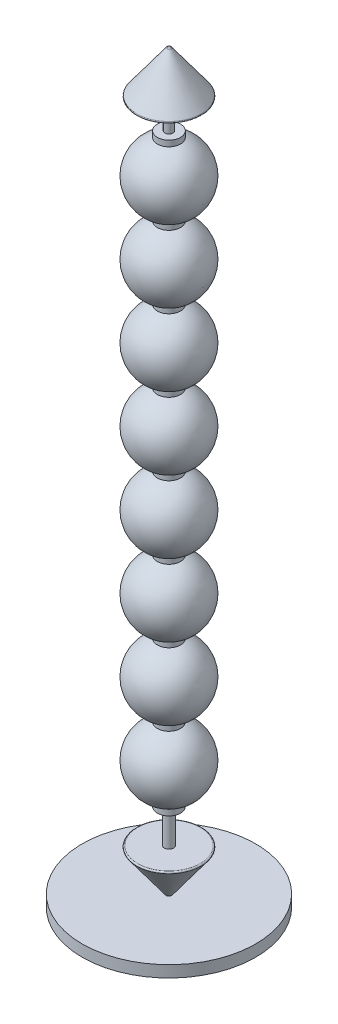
ISO-10303-21;
HEADER;
FILE_DESCRIPTION(('STEP AP214'),'2;1');
FILE_NAME('part.step','',(''),(''),'','','');
FILE_SCHEMA(('AUTOMOTIVE_DESIGN { 1 0 10303 214 1 1 1 1 }'));
ENDSEC;
DATA;
#1=APPLICATION_CONTEXT('core data for automotive mechanical design processes');
#2=APPLICATION_PROTOCOL_DEFINITION('international standard','automotive_design',2000,#1);
#3=PRODUCT_CONTEXT('',#1,'mechanical');
#4=PRODUCT('Part','Part','',(#3));
#5=PRODUCT_RELATED_PRODUCT_CATEGORY('part','',(#4));
#6=PRODUCT_DEFINITION_FORMATION('','',#4);
#7=PRODUCT_DEFINITION_CONTEXT('part definition',#1,'design');
#8=PRODUCT_DEFINITION('design','',#6,#7);
#9=PRODUCT_DEFINITION_SHAPE('','',#8);
#10=(LENGTH_UNIT() NAMED_UNIT(*) SI_UNIT(.MILLI.,.METRE.));
#11=(NAMED_UNIT(*) PLANE_ANGLE_UNIT() SI_UNIT($,.RADIAN.));
#12=(NAMED_UNIT(*) SI_UNIT($,.STERADIAN.) SOLID_ANGLE_UNIT());
#13=UNCERTAINTY_MEASURE_WITH_UNIT(LENGTH_MEASURE(1.E-05),#10,'distance_accuracy_value','');
#14=(GEOMETRIC_REPRESENTATION_CONTEXT(3) GLOBAL_UNCERTAINTY_ASSIGNED_CONTEXT((#13)) GLOBAL_UNIT_ASSIGNED_CONTEXT((#10,
#11,#12)) REPRESENTATION_CONTEXT('',''));
#15=CARTESIAN_POINT('',(0.,0.,0.));
#16=DIRECTION('',(0.,0.,1.));
#17=DIRECTION('',(1.,0.,0.));
#18=AXIS2_PLACEMENT_3D('',#15,#16,#17);
#19=CARTESIAN_POINT('',(0.,150.737071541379,0.));
#20=DIRECTION('',(0.,-1.,0.));
#21=DIRECTION('',(1.,0.,0.));
#22=AXIS2_PLACEMENT_3D('',#19,#20,#21);
#23=PLANE('',#22);
#24=CARTESIAN_POINT('',(0.,150.737071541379,0.));
#25=DIRECTION('',(0.,-1.,0.));
#26=DIRECTION('',(1.,0.,0.));
#27=AXIS2_PLACEMENT_3D('',#24,#25,#26);
#28=CIRCLE('',#27,20.);
#29=CARTESIAN_POINT('',(20.,150.737071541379,0.));
#30=VERTEX_POINT('',#29);
#31=EDGE_CURVE('E11',#30,#30,#28,.T.);
#32=ORIENTED_EDGE('',*,*,#31,.T.);
#33=EDGE_LOOP('',(#32));
#34=FACE_BOUND('',#33,.T.);
#35=ADVANCED_FACE('F39',(#34),#23,.T.);
#36=CARTESIAN_POINT('',(0.,0.,0.));
#37=DIRECTION('',(0.,-1.,0.));
#38=DIRECTION('',(1.,0.,0.));
#39=AXIS2_PLACEMENT_3D('',#36,#37,#38);
#40=CYLINDRICAL_SURFACE('',#39,20.);
#41=CARTESIAN_POINT('',(0.,160.737071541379,0.));
#42=DIRECTION('',(0.,-1.,0.));
#43=DIRECTION('',(1.,0.,0.));
#44=AXIS2_PLACEMENT_3D('',#41,#42,#43);
#45=CIRCLE('',#44,20.);
#46=CARTESIAN_POINT('',(20.,160.737071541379,0.));
#47=VERTEX_POINT('',#46);
#48=EDGE_CURVE('E45',#47,#47,#45,.T.);
#49=ORIENTED_EDGE('',*,*,#48,.T.);
#50=EDGE_LOOP('',(#49));
#51=FACE_BOUND('',#50,.T.);
#52=ORIENTED_EDGE('',*,*,#31,.F.);
#53=EDGE_LOOP('',(#52));
#54=FACE_BOUND('',#53,.T.);
#55=ADVANCED_FACE('F51',(#51,#54),#40,.T.);
#56=CARTESIAN_POINT('',(0.,160.737071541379,0.));
#57=DIRECTION('',(0.,1.,0.));
#58=DIRECTION('',(-1.,0.,0.));
#59=AXIS2_PLACEMENT_3D('',#56,#57,#58);
#60=PLANE('',#59);
#61=ORIENTED_EDGE('',*,*,#48,.F.);
#62=EDGE_LOOP('',(#61));
#63=FACE_BOUND('',#62,.T.);
#64=ADVANCED_FACE('F54',(#63),#60,.T.);
#65=CLOSED_SHELL('',(#35,#55,#64));
#66=MANIFOLD_SOLID_BREP('B2',#65);
#67=CARTESIAN_POINT('',(0.,1162.49004311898,0.));
#68=DIRECTION('',(0.,1.,0.));
#69=DIRECTION('',(0.,0.,1.));
#70=AXIS2_PLACEMENT_3D('',#67,#68,#69);
#71=PLANE('',#70);
#72=CARTESIAN_POINT('',(0.,1162.49004311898,0.));
#73=DIRECTION('',(0.,-1.,0.));
#74=DIRECTION('',(0.,0.,-1.));
#75=AXIS2_PLACEMENT_3D('',#72,#73,#74);
#76=CIRCLE('',#75,7.);
#77=CARTESIAN_POINT('',(0.,1162.49004311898,-7.));
#78=VERTEX_POINT('',#77);
#79=EDGE_CURVE('E38',#78,#78,#76,.T.);
#80=ORIENTED_EDGE('',*,*,#79,.T.);
#81=EDGE_LOOP('',(#80));
#82=FACE_BOUND('',#81,.T.);
#83=ADVANCED_FACE('F87',(#82),#71,.F.);
#84=CARTESIAN_POINT('',(0.,1162.49004311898,0.));
#85=DIRECTION('',(0.,-1.,0.));
#86=DIRECTION('',(0.,0.,-1.));
#87=AXIS2_PLACEMENT_3D('',#84,#85,#86);
#88=CYLINDRICAL_SURFACE('',#87,7.);
#89=ORIENTED_EDGE('',*,*,#79,.F.);
#90=EDGE_LOOP('',(#89));
#91=FACE_BOUND('',#90,.T.);
#92=CARTESIAN_POINT('',(0.,1212.49004311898,0.));
#93=DIRECTION('',(0.,-1.,0.));
#94=DIRECTION('',(0.,0.,-1.));
#95=AXIS2_PLACEMENT_3D('',#92,#93,#94);
#96=CIRCLE('',#95,7.);
#97=CARTESIAN_POINT('',(0.,1212.49004311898,-7.));
#98=VERTEX_POINT('',#97);
#99=EDGE_CURVE('E93',#98,#98,#96,.T.);
#100=ORIENTED_EDGE('',*,*,#99,.T.);
#101=EDGE_LOOP('',(#100));
#102=FACE_BOUND('',#101,.T.);
#103=ADVANCED_FACE('F99',(#91,#102),#88,.T.);
#104=CARTESIAN_POINT('',(-7.,1212.49004311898,0.));
#105=DIRECTION('',(0.,-1.,0.));
#106=DIRECTION('',(0.,0.,-1.));
#107=AXIS2_PLACEMENT_3D('',#104,#105,#106);
#108=PLANE('',#107);
#109=ORIENTED_EDGE('',*,*,#99,.F.);
#110=EDGE_LOOP('',(#109));
#111=FACE_BOUND('',#110,.T.);
#112=ADVANCED_FACE('F101',(#111),#108,.F.);
#113=CLOSED_SHELL('',(#83,#103,#112));
#114=MANIFOLD_SOLID_BREP('B6',#113);
#115=CARTESIAN_POINT('',(0.,92.4900431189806,0.));
#116=DIRECTION('',(0.,-1.,0.));
#117=DIRECTION('',(0.,0.,1.));
#118=AXIS2_PLACEMENT_3D('',#115,#116,#117);
#119=PLANE('',#118);
#120=CARTESIAN_POINT('',(0.,92.4900431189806,0.));
#121=DIRECTION('',(0.,1.,0.));
#122=DIRECTION('',(0.,0.,1.));
#123=AXIS2_PLACEMENT_3D('',#120,#121,#122);
#124=CIRCLE('',#123,54.0534554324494);
#125=CARTESIAN_POINT('',(0.,92.4900431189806,54.0534554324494));
#126=VERTEX_POINT('',#125);
#127=EDGE_CURVE('E150',#126,#126,#124,.F.);
#128=ORIENTED_EDGE('',*,*,#127,.F.);
#129=EDGE_LOOP('',(#128));
#130=FACE_BOUND('',#129,.T.);
#131=ADVANCED_FACE('F135',(#130),#119,.F.);
#132=CARTESIAN_POINT('',(1.04523968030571E-13,17.4900431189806,0.));
#133=DIRECTION('',(0.,1.,0.));
#134=DIRECTION('',(0.,0.,-1.));
#135=AXIS2_PLACEMENT_3D('',#132,#133,#134);
#136=CONICAL_SURFACE('',#135,3.00625566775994,0.632694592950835);
#137=CARTESIAN_POINT('',(1.043894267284E-13,18.3074032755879,0.));
#138=DIRECTION('',(0.,1.,0.));
#139=DIRECTION('',(0.,0.,1.));
#140=AXIS2_PLACEMENT_3D('',#137,#138,#139);
#141=CIRCLE('',#140,3.60558494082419);
#142=CARTESIAN_POINT('',(1.043894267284E-13,18.3074032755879,-3.6055849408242));
#143=VERTEX_POINT('',#142);
#144=EDGE_CURVE('E142',#143,#143,#141,.F.);
#145=CARTESIAN_POINT('',(0.,89.3074032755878,0.));
#146=DIRECTION('',(0.,1.,0.));
#147=DIRECTION('',(0.,0.,1.));
#148=AXIS2_PLACEMENT_3D('',#145,#146,#147);
#149=CIRCLE('',#148,55.6663295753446);
#150=CARTESIAN_POINT('',(0.,89.3074032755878,-55.6663295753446));
#151=VERTEX_POINT('',#150);
#152=EDGE_CURVE('E146',#151,#151,#149,.T.);
#153=CARTESIAN_POINT('',(1.043894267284E-13,18.3074032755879,-3.6055849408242));
#154=CARTESIAN_POINT('',(1.04267687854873E-13,19.0469866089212,-4.14788436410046));
#155=CARTESIAN_POINT('',(1.04145948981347E-13,19.7865699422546,-4.69018378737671));
#156=CARTESIAN_POINT('',(1.03902471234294E-13,21.2657366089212,-5.77478263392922));
#157=CARTESIAN_POINT('',(1.03780732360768E-13,22.0053199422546,-6.31708205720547));
#158=CARTESIAN_POINT('',(1.03537254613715E-13,23.4844866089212,-7.40168090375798));
#159=CARTESIAN_POINT('',(1.03415515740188E-13,24.2240699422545,-7.94398032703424));
#160=CARTESIAN_POINT('',(1.03172037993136E-13,25.7032366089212,-9.02857917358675));
#161=CARTESIAN_POINT('',(1.03050299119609E-13,26.4428199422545,-9.570878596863));
#162=CARTESIAN_POINT('',(1.02806821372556E-13,27.9219866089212,-10.6554774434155));
#163=CARTESIAN_POINT('',(1.0268508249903E-13,28.6615699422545,-11.1977768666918));
#164=CARTESIAN_POINT('',(1.02441604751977E-13,30.1407366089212,-12.2823757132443));
#165=CARTESIAN_POINT('',(1.02319865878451E-13,30.8803199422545,-12.8246751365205));
#166=CARTESIAN_POINT('',(1.02076388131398E-13,32.3594866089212,-13.909273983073));
#167=CARTESIAN_POINT('',(1.01954649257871E-13,33.0990699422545,-14.4515734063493));
#168=CARTESIAN_POINT('',(1.01711171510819E-13,34.5782366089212,-15.5361722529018));
#169=CARTESIAN_POINT('',(1.01589432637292E-13,35.3178199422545,-16.0784716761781));
#170=CARTESIAN_POINT('',(1.01345954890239E-13,36.7969866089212,-17.1630705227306));
#171=CARTESIAN_POINT('',(1.01224216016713E-13,37.5365699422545,-17.7053699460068));
#172=CARTESIAN_POINT('',(1.0098073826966E-13,39.0157366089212,-18.7899687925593));
#173=CARTESIAN_POINT('',(1.00858999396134E-13,39.7553199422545,-19.3322682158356));
#174=CARTESIAN_POINT('',(1.00615521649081E-13,41.2344866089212,-20.4168670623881));
#175=CARTESIAN_POINT('',(1.00493782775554E-13,41.9740699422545,-20.9591664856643));
#176=CARTESIAN_POINT('',(1.00250305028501E-13,43.4532366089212,-22.0437653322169));
#177=CARTESIAN_POINT('',(1.00128566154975E-13,44.1928199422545,-22.5860647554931));
#178=CARTESIAN_POINT('',(0.,45.6719866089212,-23.6706636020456));
#179=CARTESIAN_POINT('',(0.,46.4115699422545,-24.2129630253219));
#180=CARTESIAN_POINT('',(0.,47.8907366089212,-25.2975618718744));
#181=CARTESIAN_POINT('',(0.,48.6303199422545,-25.8398612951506));
#182=CARTESIAN_POINT('',(0.,50.1094866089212,-26.9244601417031));
#183=CARTESIAN_POINT('',(0.,50.8490699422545,-27.4667595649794));
#184=CARTESIAN_POINT('',(0.,52.3282366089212,-28.5513584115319));
#185=CARTESIAN_POINT('',(0.,53.0678199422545,-29.0936578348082));
#186=CARTESIAN_POINT('',(0.,54.5469866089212,-30.1782566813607));
#187=CARTESIAN_POINT('',(0.,55.2865699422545,-30.7205561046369));
#188=CARTESIAN_POINT('',(0.,56.7657366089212,-31.8051549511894));
#189=CARTESIAN_POINT('',(0.,57.5053199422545,-32.3474543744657));
#190=CARTESIAN_POINT('',(0.,58.9844866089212,-33.4320532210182));
#191=CARTESIAN_POINT('',(0.,59.7240699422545,-33.9743526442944));
#192=CARTESIAN_POINT('',(0.,61.2032366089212,-35.058951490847));
#193=CARTESIAN_POINT('',(0.,61.9428199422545,-35.6012509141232));
#194=CARTESIAN_POINT('',(0.,63.4219866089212,-36.6858497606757));
#195=CARTESIAN_POINT('',(0.,64.1615699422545,-37.228149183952));
#196=CARTESIAN_POINT('',(0.,65.6407366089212,-38.3127480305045));
#197=CARTESIAN_POINT('',(0.,66.3803199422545,-38.8550474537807));
#198=CARTESIAN_POINT('',(0.,67.8594866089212,-39.9396463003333));
#199=CARTESIAN_POINT('',(0.,68.5990699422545,-40.4819457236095));
#200=CARTESIAN_POINT('',(0.,70.0782366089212,-41.566544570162));
#201=CARTESIAN_POINT('',(0.,70.8178199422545,-42.1088439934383));
#202=CARTESIAN_POINT('',(0.,72.2969866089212,-43.1934428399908));
#203=CARTESIAN_POINT('',(0.,73.0365699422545,-43.735742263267));
#204=CARTESIAN_POINT('',(0.,74.5157366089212,-44.8203411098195));
#205=CARTESIAN_POINT('',(0.,75.2553199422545,-45.3626405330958));
#206=CARTESIAN_POINT('',(0.,76.7344866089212,-46.4472393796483));
#207=CARTESIAN_POINT('',(0.,77.4740699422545,-46.9895388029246));
#208=CARTESIAN_POINT('',(0.,78.9532366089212,-48.0741376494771));
#209=CARTESIAN_POINT('',(0.,79.6928199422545,-48.6164370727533));
#210=CARTESIAN_POINT('',(0.,81.1719866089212,-49.7010359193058));
#211=CARTESIAN_POINT('',(0.,81.9115699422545,-50.2433353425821));
#212=CARTESIAN_POINT('',(0.,83.3907366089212,-51.3279341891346));
#213=CARTESIAN_POINT('',(0.,84.1303199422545,-51.8702336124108));
#214=CARTESIAN_POINT('',(0.,85.6094866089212,-52.9548324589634));
#215=CARTESIAN_POINT('',(0.,86.3490699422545,-53.4971318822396));
#216=CARTESIAN_POINT('',(0.,87.8282366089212,-54.5817307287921));
#217=CARTESIAN_POINT('',(0.,88.5678199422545,-55.1240301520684));
#218=CARTESIAN_POINT('',(0.,89.3074032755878,-55.6663295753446));
#219=B_SPLINE_CURVE_WITH_KNOTS('',3,(#153,#154,#155,#156,#157,#158,#159,#160,#161,#162,#163,
#164,#165,#166,#167,#168,#169,#170,#171,#172,#173,#174,#175,#176,#177,#178,#179,#180,#181,#182,
#183,#184,#185,#186,#187,#188,#189,#190,#191,#192,#193,#194,#195,#196,#197,#198,#199,#200,#201,
#202,#203,#204,#205,#206,#207,#208,#209,#210,#211,#212,#213,#214,#215,#216,#217,#218),
.UNSPECIFIED.,.F.,.F.,(4,2,2,2,2,2,2,2,2,2,2,2,2,2,2,2,2,2,2,2,2,2,2,2,2,2,2,2,2,2,2,2,4),(0.,
2.75129960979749,5.50259921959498,8.25389882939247,11.00519843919,13.7564980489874,
16.5077976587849,19.2590972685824,22.0103968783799,24.7616964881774,27.5129960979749,
30.2642957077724,33.0155953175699,35.7668949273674,38.5181945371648,41.2694941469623,
44.0207937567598,46.7720933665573,49.5233929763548,52.2746925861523,55.0259921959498,
57.7772918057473,60.5285914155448,63.2798910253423,66.0311906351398,68.7824902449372,
71.5337898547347,74.2850894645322,77.0363890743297,79.7876886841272,82.5389882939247,
85.2902879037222,88.0415875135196),.UNSPECIFIED.);
#220=EDGE_CURVE('BSEAM159',#143,#151,#219,.T.);
#221=ORIENTED_EDGE('',*,*,#144,.F.);
#222=ORIENTED_EDGE('',*,*,#152,.F.);
#223=ORIENTED_EDGE('',*,*,#220,.T.);
#224=ORIENTED_EDGE('',*,*,#220,.F.);
#225=EDGE_LOOP('',(#221,#223,#222,#224));
#226=FACE_BOUND('',#225,.T.);
#227=ADVANCED_FACE('F159',(#226),#136,.T.);
#228=CARTESIAN_POINT('',(-3.00625566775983,17.4900431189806,0.));
#229=DIRECTION('',(0.,1.,0.));
#230=DIRECTION('',(0.,0.,-1.));
#231=AXIS2_PLACEMENT_3D('',#228,#229,#230);
#232=PLANE('',#231);
#233=CARTESIAN_POINT('',(1.04523968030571E-13,17.4900431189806,0.));
#234=DIRECTION('',(0.,-1.,0.));
#235=DIRECTION('',(0.,0.,-1.));
#236=AXIS2_PLACEMENT_3D('',#233,#234,#235);
#237=CIRCLE('',#236,1.99271079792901);
#238=CARTESIAN_POINT('',(1.04523968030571E-13,17.4900431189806,-1.99271079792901));
#239=VERTEX_POINT('',#238);
#240=EDGE_CURVE('E86',#239,#239,#237,.F.);
#241=ORIENTED_EDGE('',*,*,#240,.F.);
#242=EDGE_LOOP('',(#241));
#243=FACE_BOUND('',#242,.T.);
#244=ADVANCED_FACE('F164',(#243),#232,.F.);
#245=CARTESIAN_POINT('',(0.,90.4900431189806,0.));
#246=DIRECTION('',(0.,-1.,0.));
#247=DIRECTION('',(0.,0.,1.));
#248=AXIS2_PLACEMENT_3D('',#245,#246,#247);
#249=TOROIDAL_SURFACE('',#248,54.0534554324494,2.);
#250=ORIENTED_EDGE('',*,*,#152,.T.);
#251=EDGE_LOOP('',(#250));
#252=FACE_BOUND('',#251,.T.);
#253=ORIENTED_EDGE('',*,*,#127,.T.);
#254=EDGE_LOOP('',(#253));
#255=FACE_BOUND('',#254,.T.);
#256=ADVANCED_FACE('F156',(#252,#255),#249,.T.);
#257=CARTESIAN_POINT('',(1.04194758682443E-13,19.4900431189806,0.));
#258=DIRECTION('',(0.,1.,0.));
#259=DIRECTION('',(0.,0.,-1.));
#260=AXIS2_PLACEMENT_3D('',#257,#258,#259);
#261=DEGENERATE_TOROIDAL_SURFACE('',#260,1.99271079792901,2.,.T.);
#262=ORIENTED_EDGE('',*,*,#240,.T.);
#263=EDGE_LOOP('',(#262));
#264=FACE_BOUND('',#263,.T.);
#265=ORIENTED_EDGE('',*,*,#144,.T.);
#266=EDGE_LOOP('',(#265));
#267=FACE_BOUND('',#266,.T.);
#268=ADVANCED_FACE('F137',(#264,#267),#261,.T.);
#269=CLOSED_SHELL('',(#131,#227,#244,#256,#268));
#270=MANIFOLD_SOLID_BREP('B33',#269);
#271=CARTESIAN_POINT('',(0.,1212.49004311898,0.));
#272=DIRECTION('',(0.,1.,0.));
#273=DIRECTION('',(0.,0.,1.));
#274=AXIS2_PLACEMENT_3D('',#271,#272,#273);
#275=PLANE('',#274);
#276=CARTESIAN_POINT('',(0.,1212.49004311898,0.));
#277=DIRECTION('',(0.,1.,0.));
#278=DIRECTION('',(0.,0.,1.));
#279=AXIS2_PLACEMENT_3D('',#276,#277,#278);
#280=CIRCLE('',#279,54.0534554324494);
#281=CARTESIAN_POINT('',(0.,1212.49004311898,54.0534554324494));
#282=VERTEX_POINT('',#281);
#283=EDGE_CURVE('E228',#282,#282,#280,.F.);
#284=ORIENTED_EDGE('',*,*,#283,.T.);
#285=EDGE_LOOP('',(#284));
#286=FACE_BOUND('',#285,.T.);
#287=ADVANCED_FACE('F213',(#286),#275,.F.);
#288=CARTESIAN_POINT('',(0.,1287.49004311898,0.));
#289=DIRECTION('',(0.,-1.,0.));
#290=DIRECTION('',(0.,0.,-1.));
#291=AXIS2_PLACEMENT_3D('',#288,#289,#290);
#292=CONICAL_SURFACE('',#291,3.00625566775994,0.632694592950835);
#293=CARTESIAN_POINT('',(0.,1286.67268296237,0.));
#294=DIRECTION('',(0.,1.,0.));
#295=DIRECTION('',(0.,0.,1.));
#296=AXIS2_PLACEMENT_3D('',#293,#294,#295);
#297=CIRCLE('',#296,3.60558494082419);
#298=CARTESIAN_POINT('',(0.,1286.67268296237,-3.60558494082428));
#299=VERTEX_POINT('',#298);
#300=EDGE_CURVE('E220',#299,#299,#297,.F.);
#301=CARTESIAN_POINT('',(0.,1215.67268296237,0.));
#302=DIRECTION('',(0.,1.,0.));
#303=DIRECTION('',(0.,0.,1.));
#304=AXIS2_PLACEMENT_3D('',#301,#302,#303);
#305=CIRCLE('',#304,55.6663295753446);
#306=CARTESIAN_POINT('',(0.,1215.67268296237,-55.6663295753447));
#307=VERTEX_POINT('',#306);
#308=EDGE_CURVE('E224',#307,#307,#305,.T.);
#309=CARTESIAN_POINT('',(0.,1286.67268296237,-3.60558494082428));
#310=CARTESIAN_POINT('',(0.,1285.93309962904,-4.14788436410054));
#311=CARTESIAN_POINT('',(0.,1285.19351629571,-4.6901837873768));
#312=CARTESIAN_POINT('',(0.,1283.71434962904,-5.7747826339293));
#313=CARTESIAN_POINT('',(0.,1282.97476629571,-6.31708205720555));
#314=CARTESIAN_POINT('',(0.,1281.49559962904,-7.40168090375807));
#315=CARTESIAN_POINT('',(0.,1280.75601629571,-7.94398032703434));
#316=CARTESIAN_POINT('',(0.,1279.27684962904,-9.02857917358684));
#317=CARTESIAN_POINT('',(0.,1278.53726629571,-9.57087859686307));
#318=CARTESIAN_POINT('',(0.,1277.05809962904,-10.6554774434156));
#319=CARTESIAN_POINT('',(0.,1276.31851629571,-11.1977768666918));
#320=CARTESIAN_POINT('',(0.,1274.83934962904,-12.2823757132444));
#321=CARTESIAN_POINT('',(0.,1274.09976629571,-12.8246751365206));
#322=CARTESIAN_POINT('',(0.,1272.62059962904,-13.9092739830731));
#323=CARTESIAN_POINT('',(0.,1271.88101629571,-14.4515734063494));
#324=CARTESIAN_POINT('',(0.,1270.40184962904,-15.5361722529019));
#325=CARTESIAN_POINT('',(0.,1269.66226629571,-16.0784716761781));
#326=CARTESIAN_POINT('',(0.,1268.18309962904,-17.1630705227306));
#327=CARTESIAN_POINT('',(0.,1267.44351629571,-17.7053699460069));
#328=CARTESIAN_POINT('',(0.,1265.96434962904,-18.7899687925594));
#329=CARTESIAN_POINT('',(0.,1265.22476629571,-19.3322682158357));
#330=CARTESIAN_POINT('',(0.,1263.74559962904,-20.4168670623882));
#331=CARTESIAN_POINT('',(0.,1263.00601629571,-20.9591664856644));
#332=CARTESIAN_POINT('',(0.,1261.52684962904,-22.0437653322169));
#333=CARTESIAN_POINT('',(0.,1260.78726629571,-22.5860647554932));
#334=CARTESIAN_POINT('',(0.,1259.30809962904,-23.6706636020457));
#335=CARTESIAN_POINT('',(0.,1258.56851629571,-24.212963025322));
#336=CARTESIAN_POINT('',(0.,1257.08934962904,-25.2975618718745));
#337=CARTESIAN_POINT('',(0.,1256.34976629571,-25.8398612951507));
#338=CARTESIAN_POINT('',(0.,1254.87059962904,-26.9244601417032));
#339=CARTESIAN_POINT('',(0.,1254.13101629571,-27.4667595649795));
#340=CARTESIAN_POINT('',(0.,1252.65184962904,-28.551358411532));
#341=CARTESIAN_POINT('',(0.,1251.91226629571,-29.0936578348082));
#342=CARTESIAN_POINT('',(0.,1250.43309962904,-30.1782566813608));
#343=CARTESIAN_POINT('',(0.,1249.69351629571,-30.720556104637));
#344=CARTESIAN_POINT('',(0.,1248.21434962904,-31.8051549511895));
#345=CARTESIAN_POINT('',(0.,1247.47476629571,-32.3474543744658));
#346=CARTESIAN_POINT('',(0.,1245.99559962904,-33.4320532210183));
#347=CARTESIAN_POINT('',(0.,1245.25601629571,-33.9743526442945));
#348=CARTESIAN_POINT('',(0.,1243.77684962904,-35.0589514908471));
#349=CARTESIAN_POINT('',(0.,1243.03726629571,-35.6012509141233));
#350=CARTESIAN_POINT('',(0.,1241.55809962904,-36.6858497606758));
#351=CARTESIAN_POINT('',(0.,1240.81851629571,-37.2281491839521));
#352=CARTESIAN_POINT('',(0.,1239.33934962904,-38.3127480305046));
#353=CARTESIAN_POINT('',(0.,1238.59976629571,-38.8550474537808));
#354=CARTESIAN_POINT('',(0.,1237.12059962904,-39.9396463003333));
#355=CARTESIAN_POINT('',(0.,1236.38101629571,-40.4819457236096));
#356=CARTESIAN_POINT('',(0.,1234.90184962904,-41.5665445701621));
#357=CARTESIAN_POINT('',(0.,1234.16226629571,-42.1088439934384));
#358=CARTESIAN_POINT('',(0.,1232.68309962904,-43.1934428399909));
#359=CARTESIAN_POINT('',(0.,1231.94351629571,-43.7357422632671));
#360=CARTESIAN_POINT('',(0.,1230.46434962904,-44.8203411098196));
#361=CARTESIAN_POINT('',(0.,1229.72476629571,-45.3626405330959));
#362=CARTESIAN_POINT('',(0.,1228.24559962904,-46.4472393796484));
#363=CARTESIAN_POINT('',(0.,1227.50601629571,-46.9895388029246));
#364=CARTESIAN_POINT('',(0.,1226.02684962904,-48.0741376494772));
#365=CARTESIAN_POINT('',(0.,1225.28726629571,-48.6164370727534));
#366=CARTESIAN_POINT('',(0.,1223.80809962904,-49.7010359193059));
#367=CARTESIAN_POINT('',(0.,1223.06851629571,-50.2433353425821));
#368=CARTESIAN_POINT('',(0.,1221.58934962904,-51.3279341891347));
#369=CARTESIAN_POINT('',(0.,1220.84976629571,-51.8702336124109));
#370=CARTESIAN_POINT('',(0.,1219.37059962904,-52.9548324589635));
#371=CARTESIAN_POINT('',(0.,1218.63101629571,-53.4971318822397));
#372=CARTESIAN_POINT('',(0.,1217.15184962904,-54.5817307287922));
#373=CARTESIAN_POINT('',(0.,1216.41226629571,-55.1240301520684));
#374=CARTESIAN_POINT('',(0.,1215.67268296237,-55.6663295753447));
#375=B_SPLINE_CURVE_WITH_KNOTS('',3,(#309,#310,#311,#312,#313,#314,#315,#316,#317,#318,#319,
#320,#321,#322,#323,#324,#325,#326,#327,#328,#329,#330,#331,#332,#333,#334,#335,#336,#337,#338,
#339,#340,#341,#342,#343,#344,#345,#346,#347,#348,#349,#350,#351,#352,#353,#354,#355,#356,#357,
#358,#359,#360,#361,#362,#363,#364,#365,#366,#367,#368,#369,#370,#371,#372,#373,#374),
.UNSPECIFIED.,.F.,.F.,(4,2,2,2,2,2,2,2,2,2,2,2,2,2,2,2,2,2,2,2,2,2,2,2,2,2,2,2,2,2,2,2,4),(0.,
2.75129960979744,5.50259921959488,8.25389882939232,11.0051984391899,13.7564980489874,
16.5077976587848,19.2590972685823,22.0103968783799,24.7616964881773,27.5129960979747,
30.2642957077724,33.0155953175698,35.7668949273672,38.5181945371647,41.2694941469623,
44.0207937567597,46.7720933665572,49.5233929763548,52.2746925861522,55.0259921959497,
57.7772918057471,60.5285914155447,63.2798910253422,66.0311906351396,68.7824902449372,
71.5337898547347,74.2850894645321,77.0363890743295,79.7876886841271,82.5389882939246,
85.290287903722,88.0415875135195),.UNSPECIFIED.);
#376=EDGE_CURVE('BSEAM244',#299,#307,#375,.T.);
#377=ORIENTED_EDGE('',*,*,#300,.T.);
#378=ORIENTED_EDGE('',*,*,#308,.T.);
#379=ORIENTED_EDGE('',*,*,#376,.T.);
#380=ORIENTED_EDGE('',*,*,#376,.F.);
#381=EDGE_LOOP('',(#377,#379,#378,#380));
#382=FACE_BOUND('',#381,.T.);
#383=ADVANCED_FACE('F244',(#382),#292,.T.);
#384=CARTESIAN_POINT('',(-3.00625566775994,1287.49004311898,0.));
#385=DIRECTION('',(0.,-1.,0.));
#386=DIRECTION('',(0.,0.,-1.));
#387=AXIS2_PLACEMENT_3D('',#384,#385,#386);
#388=PLANE('',#387);
#389=CARTESIAN_POINT('',(0.,1287.49004311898,0.));
#390=DIRECTION('',(0.,-1.,0.));
#391=DIRECTION('',(0.,0.,-1.));
#392=AXIS2_PLACEMENT_3D('',#389,#390,#391);
#393=CIRCLE('',#392,1.99271079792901);
#394=CARTESIAN_POINT('',(0.,1287.49004311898,-1.99271079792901));
#395=VERTEX_POINT('',#394);
#396=EDGE_CURVE('E134',#395,#395,#393,.F.);
#397=ORIENTED_EDGE('',*,*,#396,.T.);
#398=EDGE_LOOP('',(#397));
#399=FACE_BOUND('',#398,.T.);
#400=ADVANCED_FACE('F237',(#399),#388,.F.);
#401=CARTESIAN_POINT('',(0.,1214.49004311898,0.));
#402=DIRECTION('',(0.,1.,0.));
#403=DIRECTION('',(0.,0.,1.));
#404=AXIS2_PLACEMENT_3D('',#401,#402,#403);
#405=TOROIDAL_SURFACE('',#404,54.0534554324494,2.);
#406=ORIENTED_EDGE('',*,*,#308,.F.);
#407=EDGE_LOOP('',(#406));
#408=FACE_BOUND('',#407,.T.);
#409=ORIENTED_EDGE('',*,*,#283,.F.);
#410=EDGE_LOOP('',(#409));
#411=FACE_BOUND('',#410,.T.);
#412=ADVANCED_FACE('F235',(#408,#411),#405,.T.);
#413=CARTESIAN_POINT('',(0.,1285.49004311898,0.));
#414=DIRECTION('',(0.,-1.,0.));
#415=DIRECTION('',(0.,0.,-1.));
#416=AXIS2_PLACEMENT_3D('',#413,#414,#415);
#417=DEGENERATE_TOROIDAL_SURFACE('',#416,1.99271079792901,2.,.T.);
#418=ORIENTED_EDGE('',*,*,#396,.F.);
#419=EDGE_LOOP('',(#418));
#420=FACE_BOUND('',#419,.T.);
#421=ORIENTED_EDGE('',*,*,#300,.F.);
#422=EDGE_LOOP('',(#421));
#423=FACE_BOUND('',#422,.T.);
#424=ADVANCED_FACE('F215',(#420,#423),#417,.T.);
#425=CLOSED_SHELL('',(#287,#383,#400,#412,#424));
#426=MANIFOLD_SOLID_BREP('B81',#425);
#427=CARTESIAN_POINT('',(0.,1152.49004311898,0.));
#428=DIRECTION('',(0.,-1.,0.));
#429=DIRECTION('',(0.,0.,-1.));
#430=AXIS2_PLACEMENT_3D('',#427,#428,#429);
#431=PLANE('',#430);
#432=CARTESIAN_POINT('',(0.,1152.49004311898,0.));
#433=DIRECTION('',(0.,-1.,0.));
#434=DIRECTION('',(0.,0.,-1.));
#435=AXIS2_PLACEMENT_3D('',#432,#433,#434);
#436=CIRCLE('',#435,20.);
#437=CARTESIAN_POINT('',(0.,1152.49004311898,-20.));
#438=VERTEX_POINT('',#437);
#439=EDGE_CURVE('E212',#438,#438,#436,.T.);
#440=ORIENTED_EDGE('',*,*,#439,.T.);
#441=EDGE_LOOP('',(#440));
#442=FACE_BOUND('',#441,.T.);
#443=ADVANCED_FACE('F291',(#442),#431,.T.);
#444=CARTESIAN_POINT('',(0.,895.,0.));
#445=DIRECTION('',(0.,-1.,0.));
#446=DIRECTION('',(0.,0.,-1.));
#447=AXIS2_PLACEMENT_3D('',#444,#445,#446);
#448=CYLINDRICAL_SURFACE('',#447,20.);
#449=CARTESIAN_POINT('',(0.,1162.49004311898,0.));
#450=DIRECTION('',(0.,-1.,0.));
#451=DIRECTION('',(0.,0.,-1.));
#452=AXIS2_PLACEMENT_3D('',#449,#450,#451);
#453=CIRCLE('',#452,20.);
#454=CARTESIAN_POINT('',(0.,1162.49004311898,-20.));
#455=VERTEX_POINT('',#454);
#456=EDGE_CURVE('E297',#455,#455,#453,.T.);
#457=ORIENTED_EDGE('',*,*,#456,.T.);
#458=EDGE_LOOP('',(#457));
#459=FACE_BOUND('',#458,.T.);
#460=ORIENTED_EDGE('',*,*,#439,.F.);
#461=EDGE_LOOP('',(#460));
#462=FACE_BOUND('',#461,.T.);
#463=ADVANCED_FACE('F303',(#459,#462),#448,.T.);
#464=CARTESIAN_POINT('',(20.,1162.49004311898,0.));
#465=DIRECTION('',(0.,1.,0.));
#466=DIRECTION('',(0.,0.,1.));
#467=AXIS2_PLACEMENT_3D('',#464,#465,#466);
#468=PLANE('',#467);
#469=ORIENTED_EDGE('',*,*,#456,.F.);
#470=EDGE_LOOP('',(#469));
#471=FACE_BOUND('',#470,.T.);
#472=ADVANCED_FACE('F306',(#471),#468,.T.);
#473=CLOSED_SHELL('',(#443,#463,#472));
#474=MANIFOLD_SOLID_BREP('B129',#473);
#475=CARTESIAN_POINT('',(0.,1027.49004311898,0.));
#476=DIRECTION('',(0.,-1.,0.));
#477=DIRECTION('',(0.,0.,-1.));
#478=AXIS2_PLACEMENT_3D('',#475,#476,#477);
#479=PLANE('',#478);
#480=CARTESIAN_POINT('',(0.,1027.49004311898,0.));
#481=DIRECTION('',(0.,-1.,0.));
#482=DIRECTION('',(0.,0.,-1.));
#483=AXIS2_PLACEMENT_3D('',#480,#481,#482);
#484=CIRCLE('',#483,20.);
#485=CARTESIAN_POINT('',(0.,1027.49004311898,-20.));
#486=VERTEX_POINT('',#485);
#487=EDGE_CURVE('E290',#486,#486,#484,.T.);
#488=ORIENTED_EDGE('',*,*,#487,.T.);
#489=EDGE_LOOP('',(#488));
#490=FACE_BOUND('',#489,.T.);
#491=ADVANCED_FACE('F339',(#490),#479,.T.);
#492=CARTESIAN_POINT('',(0.,770.,0.));
#493=DIRECTION('',(0.,-1.,0.));
#494=DIRECTION('',(0.,0.,-1.));
#495=AXIS2_PLACEMENT_3D('',#492,#493,#494);
#496=CYLINDRICAL_SURFACE('',#495,20.);
#497=CARTESIAN_POINT('',(0.,1037.49004311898,0.));
#498=DIRECTION('',(0.,-1.,0.));
#499=DIRECTION('',(0.,0.,-1.));
#500=AXIS2_PLACEMENT_3D('',#497,#498,#499);
#501=CIRCLE('',#500,20.);
#502=CARTESIAN_POINT('',(0.,1037.49004311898,-20.));
#503=VERTEX_POINT('',#502);
#504=EDGE_CURVE('E345',#503,#503,#501,.T.);
#505=ORIENTED_EDGE('',*,*,#504,.T.);
#506=EDGE_LOOP('',(#505));
#507=FACE_BOUND('',#506,.T.);
#508=ORIENTED_EDGE('',*,*,#487,.F.);
#509=EDGE_LOOP('',(#508));
#510=FACE_BOUND('',#509,.T.);
#511=ADVANCED_FACE('F351',(#507,#510),#496,.T.);
#512=CARTESIAN_POINT('',(20.,1037.49004311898,0.));
#513=DIRECTION('',(0.,1.,0.));
#514=DIRECTION('',(0.,0.,1.));
#515=AXIS2_PLACEMENT_3D('',#512,#513,#514);
#516=PLANE('',#515);
#517=ORIENTED_EDGE('',*,*,#504,.F.);
#518=EDGE_LOOP('',(#517));
#519=FACE_BOUND('',#518,.T.);
#520=ADVANCED_FACE('F354',(#519),#516,.T.);
#521=CLOSED_SHELL('',(#491,#511,#520));
#522=MANIFOLD_SOLID_BREP('B207',#521);
#523=CARTESIAN_POINT('',(0.,902.490043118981,0.));
#524=DIRECTION('',(0.,-1.,0.));
#525=DIRECTION('',(0.,0.,-1.));
#526=AXIS2_PLACEMENT_3D('',#523,#524,#525);
#527=PLANE('',#526);
#528=CARTESIAN_POINT('',(0.,902.490043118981,0.));
#529=DIRECTION('',(0.,-1.,0.));
#530=DIRECTION('',(0.,0.,-1.));
#531=AXIS2_PLACEMENT_3D('',#528,#529,#530);
#532=CIRCLE('',#531,20.);
#533=CARTESIAN_POINT('',(0.,902.490043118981,-20.));
#534=VERTEX_POINT('',#533);
#535=EDGE_CURVE('E338',#534,#534,#532,.T.);
#536=ORIENTED_EDGE('',*,*,#535,.T.);
#537=EDGE_LOOP('',(#536));
#538=FACE_BOUND('',#537,.T.);
#539=ADVANCED_FACE('F387',(#538),#527,.T.);
#540=CARTESIAN_POINT('',(0.,645.,0.));
#541=DIRECTION('',(0.,-1.,0.));
#542=DIRECTION('',(0.,0.,-1.));
#543=AXIS2_PLACEMENT_3D('',#540,#541,#542);
#544=CYLINDRICAL_SURFACE('',#543,20.);
#545=CARTESIAN_POINT('',(0.,912.490043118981,0.));
#546=DIRECTION('',(0.,-1.,0.));
#547=DIRECTION('',(0.,0.,-1.));
#548=AXIS2_PLACEMENT_3D('',#545,#546,#547);
#549=CIRCLE('',#548,20.);
#550=CARTESIAN_POINT('',(0.,912.490043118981,-20.));
#551=VERTEX_POINT('',#550);
#552=EDGE_CURVE('E393',#551,#551,#549,.T.);
#553=ORIENTED_EDGE('',*,*,#552,.T.);
#554=EDGE_LOOP('',(#553));
#555=FACE_BOUND('',#554,.T.);
#556=ORIENTED_EDGE('',*,*,#535,.F.);
#557=EDGE_LOOP('',(#556));
#558=FACE_BOUND('',#557,.T.);
#559=ADVANCED_FACE('F399',(#555,#558),#544,.T.);
#560=CARTESIAN_POINT('',(20.,912.490043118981,0.));
#561=DIRECTION('',(0.,1.,0.));
#562=DIRECTION('',(0.,0.,1.));
#563=AXIS2_PLACEMENT_3D('',#560,#561,#562);
#564=PLANE('',#563);
#565=ORIENTED_EDGE('',*,*,#552,.F.);
#566=EDGE_LOOP('',(#565));
#567=FACE_BOUND('',#566,.T.);
#568=ADVANCED_FACE('F402',(#567),#564,.T.);
#569=CLOSED_SHELL('',(#539,#559,#568));
#570=MANIFOLD_SOLID_BREP('B285',#569);
#571=CARTESIAN_POINT('',(0.,777.490043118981,0.));
#572=DIRECTION('',(0.,-1.,0.));
#573=DIRECTION('',(0.,0.,-1.));
#574=AXIS2_PLACEMENT_3D('',#571,#572,#573);
#575=PLANE('',#574);
#576=CARTESIAN_POINT('',(0.,777.490043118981,0.));
#577=DIRECTION('',(0.,-1.,0.));
#578=DIRECTION('',(0.,0.,-1.));
#579=AXIS2_PLACEMENT_3D('',#576,#577,#578);
#580=CIRCLE('',#579,20.);
#581=CARTESIAN_POINT('',(0.,777.490043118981,-20.));
#582=VERTEX_POINT('',#581);
#583=EDGE_CURVE('E386',#582,#582,#580,.T.);
#584=ORIENTED_EDGE('',*,*,#583,.T.);
#585=EDGE_LOOP('',(#584));
#586=FACE_BOUND('',#585,.T.);
#587=ADVANCED_FACE('F435',(#586),#575,.T.);
#588=CARTESIAN_POINT('',(0.,520.,0.));
#589=DIRECTION('',(0.,-1.,0.));
#590=DIRECTION('',(0.,0.,-1.));
#591=AXIS2_PLACEMENT_3D('',#588,#589,#590);
#592=CYLINDRICAL_SURFACE('',#591,20.);
#593=CARTESIAN_POINT('',(0.,787.490043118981,0.));
#594=DIRECTION('',(0.,-1.,0.));
#595=DIRECTION('',(0.,0.,-1.));
#596=AXIS2_PLACEMENT_3D('',#593,#594,#595);
#597=CIRCLE('',#596,20.);
#598=CARTESIAN_POINT('',(0.,787.490043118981,-20.));
#599=VERTEX_POINT('',#598);
#600=EDGE_CURVE('E441',#599,#599,#597,.T.);
#601=ORIENTED_EDGE('',*,*,#600,.T.);
#602=EDGE_LOOP('',(#601));
#603=FACE_BOUND('',#602,.T.);
#604=ORIENTED_EDGE('',*,*,#583,.F.);
#605=EDGE_LOOP('',(#604));
#606=FACE_BOUND('',#605,.T.);
#607=ADVANCED_FACE('F447',(#603,#606),#592,.T.);
#608=CARTESIAN_POINT('',(20.,787.490043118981,0.));
#609=DIRECTION('',(0.,1.,0.));
#610=DIRECTION('',(0.,0.,1.));
#611=AXIS2_PLACEMENT_3D('',#608,#609,#610);
#612=PLANE('',#611);
#613=ORIENTED_EDGE('',*,*,#600,.F.);
#614=EDGE_LOOP('',(#613));
#615=FACE_BOUND('',#614,.T.);
#616=ADVANCED_FACE('F450',(#615),#612,.T.);
#617=CLOSED_SHELL('',(#587,#607,#616));
#618=MANIFOLD_SOLID_BREP('B333',#617);
#619=CARTESIAN_POINT('',(0.,652.490043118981,0.));
#620=DIRECTION('',(0.,-1.,0.));
#621=DIRECTION('',(0.,0.,-1.));
#622=AXIS2_PLACEMENT_3D('',#619,#620,#621);
#623=PLANE('',#622);
#624=CARTESIAN_POINT('',(0.,652.490043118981,0.));
#625=DIRECTION('',(0.,-1.,0.));
#626=DIRECTION('',(0.,0.,-1.));
#627=AXIS2_PLACEMENT_3D('',#624,#625,#626);
#628=CIRCLE('',#627,20.);
#629=CARTESIAN_POINT('',(0.,652.490043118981,-20.));
#630=VERTEX_POINT('',#629);
#631=EDGE_CURVE('E434',#630,#630,#628,.T.);
#632=ORIENTED_EDGE('',*,*,#631,.T.);
#633=EDGE_LOOP('',(#632));
#634=FACE_BOUND('',#633,.T.);
#635=ADVANCED_FACE('F483',(#634),#623,.T.);
#636=CARTESIAN_POINT('',(0.,395.,0.));
#637=DIRECTION('',(0.,-1.,0.));
#638=DIRECTION('',(0.,0.,-1.));
#639=AXIS2_PLACEMENT_3D('',#636,#637,#638);
#640=CYLINDRICAL_SURFACE('',#639,20.);
#641=CARTESIAN_POINT('',(0.,662.490043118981,0.));
#642=DIRECTION('',(0.,-1.,0.));
#643=DIRECTION('',(0.,0.,-1.));
#644=AXIS2_PLACEMENT_3D('',#641,#642,#643);
#645=CIRCLE('',#644,20.);
#646=CARTESIAN_POINT('',(0.,662.490043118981,-20.));
#647=VERTEX_POINT('',#646);
#648=EDGE_CURVE('E489',#647,#647,#645,.T.);
#649=ORIENTED_EDGE('',*,*,#648,.T.);
#650=EDGE_LOOP('',(#649));
#651=FACE_BOUND('',#650,.T.);
#652=ORIENTED_EDGE('',*,*,#631,.F.);
#653=EDGE_LOOP('',(#652));
#654=FACE_BOUND('',#653,.T.);
#655=ADVANCED_FACE('F495',(#651,#654),#640,.T.);
#656=CARTESIAN_POINT('',(20.,662.490043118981,0.));
#657=DIRECTION('',(0.,1.,0.));
#658=DIRECTION('',(0.,0.,1.));
#659=AXIS2_PLACEMENT_3D('',#656,#657,#658);
#660=PLANE('',#659);
#661=ORIENTED_EDGE('',*,*,#648,.F.);
#662=EDGE_LOOP('',(#661));
#663=FACE_BOUND('',#662,.T.);
#664=ADVANCED_FACE('F498',(#663),#660,.T.);
#665=CLOSED_SHELL('',(#635,#655,#664));
#666=MANIFOLD_SOLID_BREP('B381',#665);
#667=CARTESIAN_POINT('',(0.,527.490043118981,0.));
#668=DIRECTION('',(0.,-1.,0.));
#669=DIRECTION('',(0.,0.,-1.));
#670=AXIS2_PLACEMENT_3D('',#667,#668,#669);
#671=PLANE('',#670);
#672=CARTESIAN_POINT('',(0.,527.490043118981,0.));
#673=DIRECTION('',(0.,-1.,0.));
#674=DIRECTION('',(0.,0.,-1.));
#675=AXIS2_PLACEMENT_3D('',#672,#673,#674);
#676=CIRCLE('',#675,20.);
#677=CARTESIAN_POINT('',(0.,527.490043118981,-20.));
#678=VERTEX_POINT('',#677);
#679=EDGE_CURVE('E482',#678,#678,#676,.T.);
#680=ORIENTED_EDGE('',*,*,#679,.T.);
#681=EDGE_LOOP('',(#680));
#682=FACE_BOUND('',#681,.T.);
#683=ADVANCED_FACE('F531',(#682),#671,.T.);
#684=CARTESIAN_POINT('',(0.,270.,0.));
#685=DIRECTION('',(0.,-1.,0.));
#686=DIRECTION('',(0.,0.,-1.));
#687=AXIS2_PLACEMENT_3D('',#684,#685,#686);
#688=CYLINDRICAL_SURFACE('',#687,20.);
#689=CARTESIAN_POINT('',(0.,537.490043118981,0.));
#690=DIRECTION('',(0.,-1.,0.));
#691=DIRECTION('',(0.,0.,-1.));
#692=AXIS2_PLACEMENT_3D('',#689,#690,#691);
#693=CIRCLE('',#692,20.);
#694=CARTESIAN_POINT('',(0.,537.490043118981,-20.));
#695=VERTEX_POINT('',#694);
#696=EDGE_CURVE('E537',#695,#695,#693,.T.);
#697=ORIENTED_EDGE('',*,*,#696,.T.);
#698=EDGE_LOOP('',(#697));
#699=FACE_BOUND('',#698,.T.);
#700=ORIENTED_EDGE('',*,*,#679,.F.);
#701=EDGE_LOOP('',(#700));
#702=FACE_BOUND('',#701,.T.);
#703=ADVANCED_FACE('F543',(#699,#702),#688,.T.);
#704=CARTESIAN_POINT('',(20.,537.490043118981,0.));
#705=DIRECTION('',(0.,1.,0.));
#706=DIRECTION('',(0.,0.,1.));
#707=AXIS2_PLACEMENT_3D('',#704,#705,#706);
#708=PLANE('',#707);
#709=ORIENTED_EDGE('',*,*,#696,.F.);
#710=EDGE_LOOP('',(#709));
#711=FACE_BOUND('',#710,.T.);
#712=ADVANCED_FACE('F546',(#711),#708,.T.);
#713=CLOSED_SHELL('',(#683,#703,#712));
#714=MANIFOLD_SOLID_BREP('B429',#713);
#715=CARTESIAN_POINT('',(0.,402.490043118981,0.));
#716=DIRECTION('',(0.,-1.,0.));
#717=DIRECTION('',(0.,0.,-1.));
#718=AXIS2_PLACEMENT_3D('',#715,#716,#717);
#719=PLANE('',#718);
#720=CARTESIAN_POINT('',(0.,402.490043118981,0.));
#721=DIRECTION('',(0.,-1.,0.));
#722=DIRECTION('',(0.,0.,-1.));
#723=AXIS2_PLACEMENT_3D('',#720,#721,#722);
#724=CIRCLE('',#723,20.);
#725=CARTESIAN_POINT('',(0.,402.490043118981,-20.));
#726=VERTEX_POINT('',#725);
#727=EDGE_CURVE('E530',#726,#726,#724,.T.);
#728=ORIENTED_EDGE('',*,*,#727,.T.);
#729=EDGE_LOOP('',(#728));
#730=FACE_BOUND('',#729,.T.);
#731=ADVANCED_FACE('F577',(#730),#719,.T.);
#732=CARTESIAN_POINT('',(0.,145.,0.));
#733=DIRECTION('',(0.,-1.,0.));
#734=DIRECTION('',(0.,0.,-1.));
#735=AXIS2_PLACEMENT_3D('',#732,#733,#734);
#736=CYLINDRICAL_SURFACE('',#735,20.);
#737=CARTESIAN_POINT('',(0.,412.490043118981,0.));
#738=DIRECTION('',(0.,-1.,0.));
#739=DIRECTION('',(0.,0.,-1.));
#740=AXIS2_PLACEMENT_3D('',#737,#738,#739);
#741=CIRCLE('',#740,20.);
#742=CARTESIAN_POINT('',(0.,412.490043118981,-20.));
#743=VERTEX_POINT('',#742);
#744=EDGE_CURVE('E583',#743,#743,#741,.T.);
#745=ORIENTED_EDGE('',*,*,#744,.T.);
#746=EDGE_LOOP('',(#745));
#747=FACE_BOUND('',#746,.T.);
#748=ORIENTED_EDGE('',*,*,#727,.F.);
#749=EDGE_LOOP('',(#748));
#750=FACE_BOUND('',#749,.T.);
#751=ADVANCED_FACE('F589',(#747,#750),#736,.T.);
#752=CARTESIAN_POINT('',(20.,412.490043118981,0.));
#753=DIRECTION('',(0.,1.,0.));
#754=DIRECTION('',(0.,0.,1.));
#755=AXIS2_PLACEMENT_3D('',#752,#753,#754);
#756=PLANE('',#755);
#757=ORIENTED_EDGE('',*,*,#744,.F.);
#758=EDGE_LOOP('',(#757));
#759=FACE_BOUND('',#758,.T.);
#760=ADVANCED_FACE('F592',(#759),#756,.T.);
#761=CLOSED_SHELL('',(#731,#751,#760));
#762=MANIFOLD_SOLID_BREP('B477',#761);
#763=CARTESIAN_POINT('',(0.,1095.,0.));
#764=DIRECTION('',(0.,1.,0.));
#765=DIRECTION('',(1.,0.,0.));
#766=AXIS2_PLACEMENT_3D('',#763,#764,#765);
#767=SPHERICAL_SURFACE('',#766,60.);
#768=CARTESIAN_POINT('',(0.,1155.,0.));
#769=VERTEX_POINT('',#768);
#770=VERTEX_LOOP('',#769);
#771=FACE_BOUND('',#770,.T.);
#772=ADVANCED_FACE('F623',(#771),#767,.T.);
#773=CLOSED_SHELL('',(#772));
#774=MANIFOLD_SOLID_BREP('B525',#773);
#775=CARTESIAN_POINT('',(0.,970.,0.));
#776=DIRECTION('',(0.,1.,0.));
#777=DIRECTION('',(1.,0.,0.));
#778=AXIS2_PLACEMENT_3D('',#775,#776,#777);
#779=SPHERICAL_SURFACE('',#778,60.);
#780=CARTESIAN_POINT('',(0.,1030.,0.));
#781=VERTEX_POINT('',#780);
#782=VERTEX_LOOP('',#781);
#783=FACE_BOUND('',#782,.T.);
#784=ADVANCED_FACE('F641',(#783),#779,.T.);
#785=CLOSED_SHELL('',(#784));
#786=MANIFOLD_SOLID_BREP('B573',#785);
#787=CARTESIAN_POINT('',(0.,845.,0.));
#788=DIRECTION('',(0.,1.,0.));
#789=DIRECTION('',(1.,0.,0.));
#790=AXIS2_PLACEMENT_3D('',#787,#788,#789);
#791=SPHERICAL_SURFACE('',#790,60.);
#792=CARTESIAN_POINT('',(0.,905.,0.));
#793=VERTEX_POINT('',#792);
#794=VERTEX_LOOP('',#793);
#795=FACE_BOUND('',#794,.T.);
#796=ADVANCED_FACE('F659',(#795),#791,.T.);
#797=CLOSED_SHELL('',(#796));
#798=MANIFOLD_SOLID_BREP('B619',#797);
#799=CARTESIAN_POINT('',(0.,720.,0.));
#800=DIRECTION('',(0.,1.,0.));
#801=DIRECTION('',(1.,0.,0.));
#802=AXIS2_PLACEMENT_3D('',#799,#800,#801);
#803=SPHERICAL_SURFACE('',#802,60.);
#804=CARTESIAN_POINT('',(0.,780.,0.));
#805=VERTEX_POINT('',#804);
#806=VERTEX_LOOP('',#805);
#807=FACE_BOUND('',#806,.T.);
#808=ADVANCED_FACE('F677',(#807),#803,.T.);
#809=CLOSED_SHELL('',(#808));
#810=MANIFOLD_SOLID_BREP('B637',#809);
#811=CARTESIAN_POINT('',(0.,595.,0.));
#812=DIRECTION('',(0.,1.,0.));
#813=DIRECTION('',(1.,0.,0.));
#814=AXIS2_PLACEMENT_3D('',#811,#812,#813);
#815=SPHERICAL_SURFACE('',#814,60.);
#816=CARTESIAN_POINT('',(0.,655.,0.));
#817=VERTEX_POINT('',#816);
#818=VERTEX_LOOP('',#817);
#819=FACE_BOUND('',#818,.T.);
#820=ADVANCED_FACE('F695',(#819),#815,.T.);
#821=CLOSED_SHELL('',(#820));
#822=MANIFOLD_SOLID_BREP('B655',#821);
#823=CARTESIAN_POINT('',(0.,470.,0.));
#824=DIRECTION('',(0.,1.,0.));
#825=DIRECTION('',(1.,0.,0.));
#826=AXIS2_PLACEMENT_3D('',#823,#824,#825);
#827=SPHERICAL_SURFACE('',#826,60.);
#828=CARTESIAN_POINT('',(0.,530.,0.));
#829=VERTEX_POINT('',#828);
#830=VERTEX_LOOP('',#829);
#831=FACE_BOUND('',#830,.T.);
#832=ADVANCED_FACE('F713',(#831),#827,.T.);
#833=CLOSED_SHELL('',(#832));
#834=MANIFOLD_SOLID_BREP('B673',#833);
#835=CARTESIAN_POINT('',(0.,345.,0.));
#836=DIRECTION('',(0.,1.,0.));
#837=DIRECTION('',(1.,0.,0.));
#838=AXIS2_PLACEMENT_3D('',#835,#836,#837);
#839=SPHERICAL_SURFACE('',#838,60.);
#840=CARTESIAN_POINT('',(0.,405.,0.));
#841=VERTEX_POINT('',#840);
#842=VERTEX_LOOP('',#841);
#843=FACE_BOUND('',#842,.T.);
#844=ADVANCED_FACE('F733',(#843),#839,.T.);
#845=CLOSED_SHELL('',(#844));
#846=MANIFOLD_SOLID_BREP('B691',#845);
#847=CARTESIAN_POINT('',(0.,277.490043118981,0.));
#848=DIRECTION('',(0.,-1.,0.));
#849=DIRECTION('',(0.,0.,-1.));
#850=AXIS2_PLACEMENT_3D('',#847,#848,#849);
#851=PLANE('',#850);
#852=CARTESIAN_POINT('',(0.,277.490043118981,0.));
#853=DIRECTION('',(0.,-1.,0.));
#854=DIRECTION('',(0.,0.,-1.));
#855=AXIS2_PLACEMENT_3D('',#852,#853,#854);
#856=CIRCLE('',#855,20.);
#857=CARTESIAN_POINT('',(0.,277.490043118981,-20.));
#858=VERTEX_POINT('',#857);
#859=EDGE_CURVE('E732',#858,#858,#856,.T.);
#860=ORIENTED_EDGE('',*,*,#859,.T.);
#861=EDGE_LOOP('',(#860));
#862=FACE_BOUND('',#861,.T.);
#863=ADVANCED_FACE('F751',(#862),#851,.T.);
#864=CARTESIAN_POINT('',(0.,20.,0.));
#865=DIRECTION('',(0.,-1.,0.));
#866=DIRECTION('',(0.,0.,-1.));
#867=AXIS2_PLACEMENT_3D('',#864,#865,#866);
#868=CYLINDRICAL_SURFACE('',#867,20.);
#869=CARTESIAN_POINT('',(0.,287.490043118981,0.));
#870=DIRECTION('',(0.,-1.,0.));
#871=DIRECTION('',(0.,0.,-1.));
#872=AXIS2_PLACEMENT_3D('',#869,#870,#871);
#873=CIRCLE('',#872,20.);
#874=CARTESIAN_POINT('',(0.,287.490043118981,-20.));
#875=VERTEX_POINT('',#874);
#876=EDGE_CURVE('E757',#875,#875,#873,.T.);
#877=ORIENTED_EDGE('',*,*,#876,.T.);
#878=EDGE_LOOP('',(#877));
#879=FACE_BOUND('',#878,.T.);
#880=ORIENTED_EDGE('',*,*,#859,.F.);
#881=EDGE_LOOP('',(#880));
#882=FACE_BOUND('',#881,.T.);
#883=ADVANCED_FACE('F763',(#879,#882),#868,.T.);
#884=CARTESIAN_POINT('',(20.,287.490043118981,0.));
#885=DIRECTION('',(0.,1.,0.));
#886=DIRECTION('',(0.,0.,1.));
#887=AXIS2_PLACEMENT_3D('',#884,#885,#886);
#888=PLANE('',#887);
#889=ORIENTED_EDGE('',*,*,#876,.F.);
#890=EDGE_LOOP('',(#889));
#891=FACE_BOUND('',#890,.T.);
#892=ADVANCED_FACE('F766',(#891),#888,.T.);
#893=CLOSED_SHELL('',(#863,#883,#892));
#894=MANIFOLD_SOLID_BREP('B709',#893);
#895=CARTESIAN_POINT('',(0.,220.,0.));
#896=DIRECTION('',(0.,1.,0.));
#897=DIRECTION('',(1.,0.,0.));
#898=AXIS2_PLACEMENT_3D('',#895,#896,#897);
#899=SPHERICAL_SURFACE('',#898,60.);
#900=CARTESIAN_POINT('',(0.,280.,0.));
#901=VERTEX_POINT('',#900);
#902=VERTEX_LOOP('',#901);
#903=FACE_BOUND('',#902,.T.);
#904=ADVANCED_FACE('F799',(#903),#899,.T.);
#905=CLOSED_SHELL('',(#904));
#906=MANIFOLD_SOLID_BREP('B727',#905);
#907=CARTESIAN_POINT('',(0.,170.,0.));
#908=DIRECTION('',(0.,-1.,0.));
#909=DIRECTION('',(0.,0.,-1.));
#910=AXIS2_PLACEMENT_3D('',#907,#908,#909);
#911=CYLINDRICAL_SURFACE('',#910,8.);
#912=CARTESIAN_POINT('',(0.,27.7178424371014,0.));
#913=DIRECTION('',(0.,1.,0.));
#914=DIRECTION('',(0.,0.,1.));
#915=AXIS2_PLACEMENT_3D('',#912,#913,#914);
#916=CIRCLE('',#915,8.);
#917=CARTESIAN_POINT('',(0.,27.7178424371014,8.));
#918=VERTEX_POINT('',#917);
#919=EDGE_CURVE('E821',#918,#918,#916,.T.);
#920=ORIENTED_EDGE('',*,*,#919,.T.);
#921=EDGE_LOOP('',(#920));
#922=FACE_BOUND('',#921,.T.);
#923=CARTESIAN_POINT('',(0.,170.,0.));
#924=DIRECTION('',(0.,1.,0.));
#925=DIRECTION('',(0.,0.,1.));
#926=AXIS2_PLACEMENT_3D('',#923,#924,#925);
#927=CIRCLE('',#926,8.);
#928=CARTESIAN_POINT('',(0.,170.,8.));
#929=VERTEX_POINT('',#928);
#930=EDGE_CURVE('E798',#929,#929,#927,.T.);
#931=ORIENTED_EDGE('',*,*,#930,.F.);
#932=EDGE_LOOP('',(#931));
#933=FACE_BOUND('',#932,.T.);
#934=ADVANCED_FACE('F818',(#922,#933),#911,.T.);
#935=CARTESIAN_POINT('',(0.,170.,0.));
#936=DIRECTION('',(0.,1.,0.));
#937=DIRECTION('',(0.,0.,1.));
#938=AXIS2_PLACEMENT_3D('',#935,#936,#937);
#939=PLANE('',#938);
#940=ORIENTED_EDGE('',*,*,#930,.T.);
#941=EDGE_LOOP('',(#940));
#942=FACE_BOUND('',#941,.T.);
#943=ADVANCED_FACE('F834',(#942),#939,.T.);
#944=CARTESIAN_POINT('',(-19.6900836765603,27.7178424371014,-10.));
#945=DIRECTION('',(0.,1.,0.));
#946=DIRECTION('',(0.,0.,1.));
#947=AXIS2_PLACEMENT_3D('',#944,#945,#946);
#948=PLANE('',#947);
#949=ORIENTED_EDGE('',*,*,#919,.F.);
#950=EDGE_LOOP('',(#949));
#951=FACE_BOUND('',#950,.T.);
#952=ADVANCED_FACE('F832',(#951),#948,.F.);
#953=CLOSED_SHELL('',(#934,#943,#952));
#954=MANIFOLD_SOLID_BREP('B747',#953);
#955=CARTESIAN_POINT('',(0.,20.,0.));
#956=DIRECTION('',(0.,-1.,0.));
#957=DIRECTION('',(0.,0.,-1.));
#958=AXIS2_PLACEMENT_3D('',#955,#956,#957);
#959=CYLINDRICAL_SURFACE('',#958,150.);
#960=CARTESIAN_POINT('',(0.,20.,0.));
#961=DIRECTION('',(0.,1.,0.));
#962=DIRECTION('',(0.,0.,1.));
#963=AXIS2_PLACEMENT_3D('',#960,#961,#962);
#964=CIRCLE('',#963,150.);
#965=CARTESIAN_POINT('',(0.,20.,150.));
#966=VERTEX_POINT('',#965);
#967=EDGE_CURVE('E817',#966,#966,#964,.T.);
#968=ORIENTED_EDGE('',*,*,#967,.F.);
#969=EDGE_LOOP('',(#968));
#970=FACE_BOUND('',#969,.T.);
#971=CARTESIAN_POINT('',(0.,0.,0.));
#972=DIRECTION('',(0.,1.,0.));
#973=DIRECTION('',(0.,0.,1.));
#974=AXIS2_PLACEMENT_3D('',#971,#972,#973);
#975=CIRCLE('',#974,150.);
#976=CARTESIAN_POINT('',(0.,0.,150.));
#977=VERTEX_POINT('',#976);
#978=EDGE_CURVE('E861',#977,#977,#975,.T.);
#979=ORIENTED_EDGE('',*,*,#978,.T.);
#980=EDGE_LOOP('',(#979));
#981=FACE_BOUND('',#980,.T.);
#982=ADVANCED_FACE('F858',(#970,#981),#959,.T.);
#983=CARTESIAN_POINT('',(0.,20.,0.));
#984=DIRECTION('',(0.,1.,0.));
#985=DIRECTION('',(0.,0.,1.));
#986=AXIS2_PLACEMENT_3D('',#983,#984,#985);
#987=PLANE('',#986);
#988=ORIENTED_EDGE('',*,*,#967,.T.);
#989=EDGE_LOOP('',(#988));
#990=FACE_BOUND('',#989,.T.);
#991=ADVANCED_FACE('F873',(#990),#987,.T.);
#992=CARTESIAN_POINT('',(0.,0.,0.));
#993=DIRECTION('',(0.,1.,0.));
#994=DIRECTION('',(0.,0.,1.));
#995=AXIS2_PLACEMENT_3D('',#992,#993,#994);
#996=PLANE('',#995);
#997=ORIENTED_EDGE('',*,*,#978,.F.);
#998=EDGE_LOOP('',(#997));
#999=FACE_BOUND('',#998,.T.);
#1000=ADVANCED_FACE('F871',(#999),#996,.F.);
#1001=CLOSED_SHELL('',(#982,#991,#1000));
#1002=MANIFOLD_SOLID_BREP('B793',#1001);
#1003=ADVANCED_BREP_SHAPE_REPRESENTATION('',(#18,#66,#114,#270,#426,#474,#522,#570,#618,#666,
#714,#762,#774,#786,#798,#810,#822,#834,#846,#894,#906,#954,#1002),#14);
#1004=SHAPE_DEFINITION_REPRESENTATION(#9,#1003);
ENDSEC;
END-ISO-10303-21;
